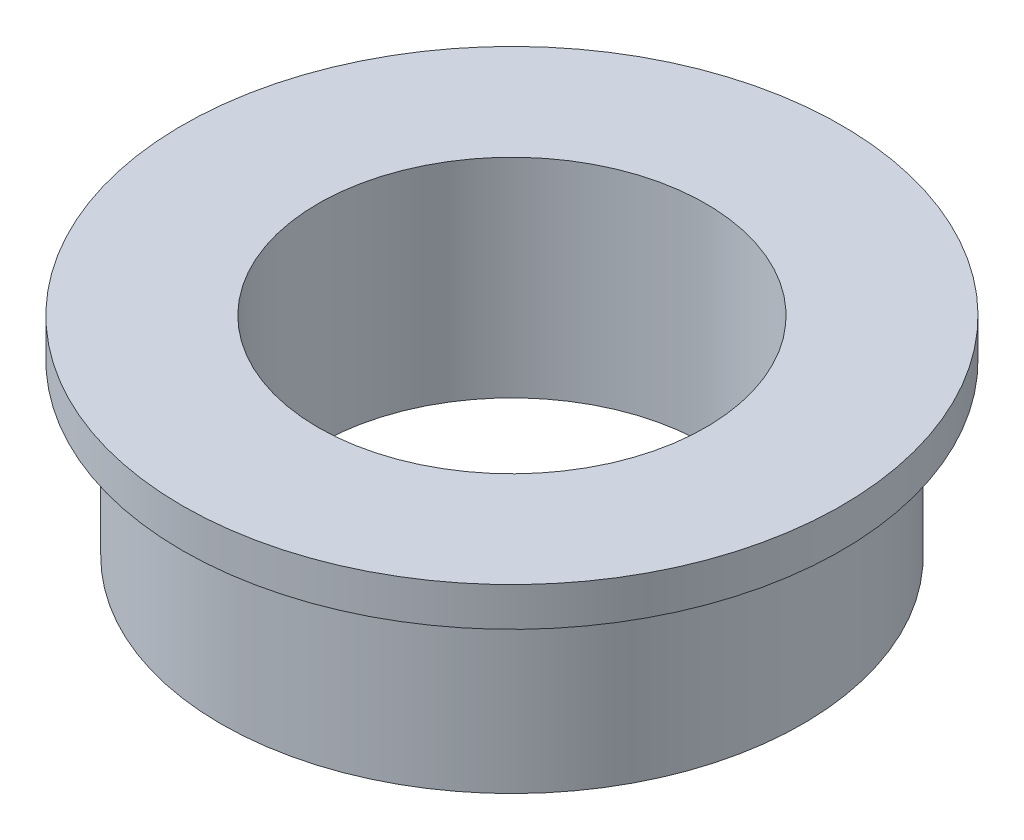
from build123d import *

# Parameters (mm, degrees)
SKETCH_1_R      = 6
SKETCH_1_R_2    = 4
EXTRUDE_1_DEPTH = 3.5
SKETCH_2_R      = 6.8
SKETCH_2_R_2    = 4
EXTRUDE_2_DEPTH = 0.8


with BuildPart() as part:
    # Sketch 1 → Extrude 1 (new body)
    with BuildSketch(Plane(origin=(0, 0, 0), x_dir=(1, 0, 0), z_dir=(0, 1, 0))):
        with Locations(Location((0, 0, 0), (0, 0, 270))):
            Circle(SKETCH_1_R)
        with Locations(Location((0, 0, 0), (0, 0, 270))):
            Circle(SKETCH_1_R_2, mode=Mode.SUBTRACT)
    extrude(amount=EXTRUDE_1_DEPTH)

    # Sketch 2 → Extrude 2 (add)
    with BuildSketch(Plane(origin=(0, 3.5, 0), x_dir=(1, 0, 0), z_dir=(0, 1, 0))):
        with Locations(Location((0, 0, 0), (0, 0, 270))):
            Circle(SKETCH_2_R)
        with Locations(Location((0, 0, 0), (0, 0, 270))):
            Circle(SKETCH_2_R_2, mode=Mode.SUBTRACT)
    extrude(amount=EXTRUDE_2_DEPTH)


solid = part.part
